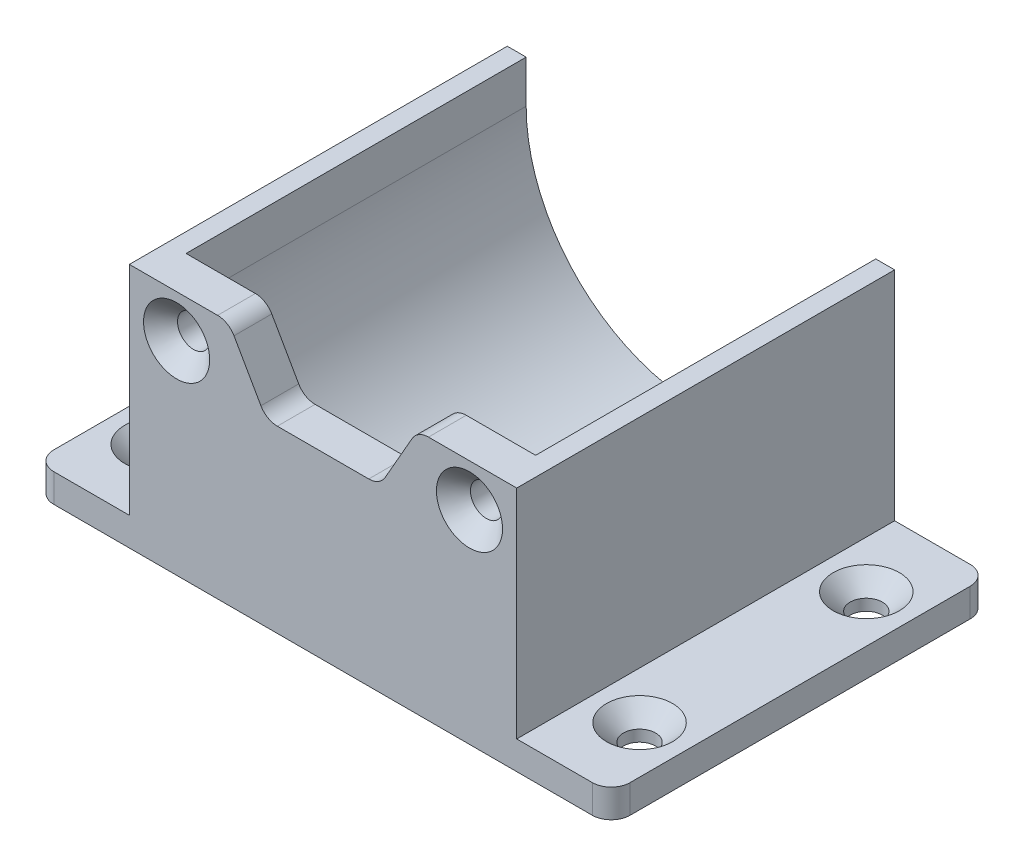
ISO-10303-21;
HEADER;
FILE_DESCRIPTION(('STEP AP214'),'2;1');
FILE_NAME('part.step','',(''),(''),'','','');
FILE_SCHEMA(('AUTOMOTIVE_DESIGN { 1 0 10303 214 1 1 1 1 }'));
ENDSEC;
DATA;
#1=APPLICATION_CONTEXT('core data for automotive mechanical design processes');
#2=APPLICATION_PROTOCOL_DEFINITION('international standard','automotive_design',2000,#1);
#3=PRODUCT_CONTEXT('',#1,'mechanical');
#4=PRODUCT('Part','Part','',(#3));
#5=PRODUCT_RELATED_PRODUCT_CATEGORY('part','',(#4));
#6=PRODUCT_DEFINITION_FORMATION('','',#4);
#7=PRODUCT_DEFINITION_CONTEXT('part definition',#1,'design');
#8=PRODUCT_DEFINITION('design','',#6,#7);
#9=PRODUCT_DEFINITION_SHAPE('','',#8);
#10=(LENGTH_UNIT() NAMED_UNIT(*) SI_UNIT(.MILLI.,.METRE.));
#11=(NAMED_UNIT(*) PLANE_ANGLE_UNIT() SI_UNIT($,.RADIAN.));
#12=(NAMED_UNIT(*) SI_UNIT($,.STERADIAN.) SOLID_ANGLE_UNIT());
#13=UNCERTAINTY_MEASURE_WITH_UNIT(LENGTH_MEASURE(1.E-05),#10,'distance_accuracy_value','');
#14=(GEOMETRIC_REPRESENTATION_CONTEXT(3) GLOBAL_UNCERTAINTY_ASSIGNED_CONTEXT((#13)) GLOBAL_UNIT_ASSIGNED_CONTEXT((#10,
#11,#12)) REPRESENTATION_CONTEXT('',''));
#15=CARTESIAN_POINT('',(0.,0.,0.));
#16=DIRECTION('',(0.,0.,1.));
#17=DIRECTION('',(1.,0.,0.));
#18=AXIS2_PLACEMENT_3D('',#15,#16,#17);
#19=CARTESIAN_POINT('',(0.,8.5,36.));
#20=DIRECTION('',(0.,0.,-1.));
#21=DIRECTION('',(-1.,0.,0.));
#22=AXIS2_PLACEMENT_3D('',#19,#20,#21);
#23=CYLINDRICAL_SURFACE('',#22,18.5);
#24=CARTESIAN_POINT('',(0.,8.5,0.));
#25=DIRECTION('',(0.,0.,1.));
#26=DIRECTION('',(1.,0.,0.));
#27=AXIS2_PLACEMENT_3D('',#24,#25,#26);
#28=CIRCLE('',#27,18.5);
#29=CARTESIAN_POINT('',(-18.5,8.49999999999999,0.));
#30=VERTEX_POINT('',#29);
#31=CARTESIAN_POINT('',(18.5,8.5,0.));
#32=VERTEX_POINT('',#31);
#33=EDGE_CURVE('E252',#30,#32,#28,.T.);
#34=ORIENTED_EDGE('',*,*,#33,.F.);
#35=DIRECTION('',(0.,0.,-1.));
#36=VECTOR('',#35,1.);
#37=CARTESIAN_POINT('',(-18.5,8.49999999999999,36.));
#38=LINE('',#37,#36);
#39=CARTESIAN_POINT('',(-18.5,8.49999999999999,36.));
#40=VERTEX_POINT('',#39);
#41=EDGE_CURVE('E428',#40,#30,#38,.T.);
#42=ORIENTED_EDGE('',*,*,#41,.F.);
#43=CARTESIAN_POINT('',(0.,8.5,36.));
#44=DIRECTION('',(0.,0.,-1.));
#45=DIRECTION('',(-1.,0.,0.));
#46=AXIS2_PLACEMENT_3D('',#43,#44,#45);
#47=CIRCLE('',#46,18.5);
#48=CARTESIAN_POINT('',(18.5,8.5,36.));
#49=VERTEX_POINT('',#48);
#50=EDGE_CURVE('E232',#49,#40,#47,.T.);
#51=ORIENTED_EDGE('',*,*,#50,.F.);
#52=DIRECTION('',(0.,0.,-1.));
#53=VECTOR('',#52,1.);
#54=CARTESIAN_POINT('',(18.5,8.5,36.));
#55=LINE('',#54,#53);
#56=EDGE_CURVE('E440',#49,#32,#55,.T.);
#57=ORIENTED_EDGE('',*,*,#56,.T.);
#58=EDGE_LOOP('',(#34,#42,#51,#57));
#59=FACE_BOUND('',#58,.T.);
#60=ADVANCED_FACE('F33',(#59),#23,.F.);
#61=CARTESIAN_POINT('',(-20.5,13.,40.));
#62=DIRECTION('',(0.,-1.,0.));
#63=DIRECTION('',(0.,0.,-1.));
#64=AXIS2_PLACEMENT_3D('',#61,#62,#63);
#65=PLANE('',#64);
#66=DIRECTION('',(1.,0.,0.));
#67=VECTOR('',#66,1.);
#68=CARTESIAN_POINT('',(-20.5,13.,36.));
#69=LINE('',#68,#67);
#70=CARTESIAN_POINT('',(-18.5,13.,36.));
#71=VERTEX_POINT('',#70);
#72=CARTESIAN_POINT('',(-11.1606450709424,13.,36.));
#73=VERTEX_POINT('',#72);
#74=EDGE_CURVE('E255',#71,#73,#69,.T.);
#75=ORIENTED_EDGE('',*,*,#74,.F.);
#76=DIRECTION('',(0.,0.,-1.));
#77=VECTOR('',#76,1.);
#78=CARTESIAN_POINT('',(-18.5,13.,36.));
#79=LINE('',#78,#77);
#80=CARTESIAN_POINT('',(-18.5,13.,0.));
#81=VERTEX_POINT('',#80);
#82=EDGE_CURVE('E430',#71,#81,#79,.T.);
#83=ORIENTED_EDGE('',*,*,#82,.T.);
#84=DIRECTION('',(-1.,0.,0.));
#85=VECTOR('',#84,1.);
#86=CARTESIAN_POINT('',(-20.5,13.,0.));
#87=LINE('',#86,#85);
#88=CARTESIAN_POINT('',(-20.5,13.,0.));
#89=VERTEX_POINT('',#88);
#90=EDGE_CURVE('E243',#81,#89,#87,.T.);
#91=ORIENTED_EDGE('',*,*,#90,.T.);
#92=DIRECTION('',(0.,0.,-1.));
#93=VECTOR('',#92,1.);
#94=CARTESIAN_POINT('',(-20.5,13.,40.));
#95=LINE('',#94,#93);
#96=CARTESIAN_POINT('',(-20.5,13.,40.));
#97=VERTEX_POINT('',#96);
#98=EDGE_CURVE('E240',#97,#89,#95,.T.);
#99=ORIENTED_EDGE('',*,*,#98,.F.);
#100=DIRECTION('',(-1.,0.,0.));
#101=VECTOR('',#100,1.);
#102=CARTESIAN_POINT('',(-20.5,13.,40.));
#103=LINE('',#102,#101);
#104=CARTESIAN_POINT('',(-11.1606450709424,13.,40.));
#105=VERTEX_POINT('',#104);
#106=EDGE_CURVE('E223',#105,#97,#103,.T.);
#107=ORIENTED_EDGE('',*,*,#106,.F.);
#108=DIRECTION('',(0.,0.,1.));
#109=VECTOR('',#108,1.);
#110=CARTESIAN_POINT('',(-11.1606450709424,13.,40.));
#111=LINE('',#110,#109);
#112=EDGE_CURVE('E312',#105,#73,#111,.F.);
#113=ORIENTED_EDGE('',*,*,#112,.T.);
#114=EDGE_LOOP('',(#75,#83,#91,#99,#107,#113));
#115=FACE_BOUND('',#114,.T.);
#116=ADVANCED_FACE('F487',(#115),#65,.F.);
#117=CARTESIAN_POINT('',(20.5,13.,40.));
#118=DIRECTION('',(-1.,0.,0.));
#119=DIRECTION('',(0.,-1.,0.));
#120=AXIS2_PLACEMENT_3D('',#117,#118,#119);
#121=PLANE('',#120);
#122=DIRECTION('',(0.,1.,0.));
#123=VECTOR('',#122,1.);
#124=CARTESIAN_POINT('',(20.5,13.,40.));
#125=LINE('',#124,#123);
#126=CARTESIAN_POINT('',(20.5,-10.,40.));
#127=VERTEX_POINT('',#126);
#128=CARTESIAN_POINT('',(20.5,13.,40.));
#129=VERTEX_POINT('',#128);
#130=EDGE_CURVE('E202',#127,#129,#125,.T.);
#131=ORIENTED_EDGE('',*,*,#130,.F.);
#132=DIRECTION('',(0.,0.,-1.));
#133=VECTOR('',#132,1.);
#134=CARTESIAN_POINT('',(20.5,-10.,40.));
#135=LINE('',#134,#133);
#136=CARTESIAN_POINT('',(20.5,-9.99999999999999,0.));
#137=VERTEX_POINT('',#136);
#138=EDGE_CURVE('E208',#127,#137,#135,.T.);
#139=ORIENTED_EDGE('',*,*,#138,.T.);
#140=DIRECTION('',(0.,1.,0.));
#141=VECTOR('',#140,1.);
#142=CARTESIAN_POINT('',(20.5,13.,0.));
#143=LINE('',#142,#141);
#144=CARTESIAN_POINT('',(20.5,13.,0.));
#145=VERTEX_POINT('',#144);
#146=EDGE_CURVE('E241',#137,#145,#143,.T.);
#147=ORIENTED_EDGE('',*,*,#146,.T.);
#148=DIRECTION('',(0.,0.,-1.));
#149=VECTOR('',#148,1.);
#150=CARTESIAN_POINT('',(20.5,13.,40.));
#151=LINE('',#150,#149);
#152=EDGE_CURVE('E222',#129,#145,#151,.T.);
#153=ORIENTED_EDGE('',*,*,#152,.F.);
#154=EDGE_LOOP('',(#131,#139,#147,#153));
#155=FACE_BOUND('',#154,.T.);
#156=ADVANCED_FACE('F220',(#155),#121,.F.);
#157=CARTESIAN_POINT('',(18.5,13.,0.));
#158=VERTEX_POINT('',#157);
#159=EDGE_CURVE('E244',#145,#158,#87,.T.);
#160=ORIENTED_EDGE('',*,*,#159,.T.);
#161=DIRECTION('',(0.,0.,-1.));
#162=VECTOR('',#161,1.);
#163=CARTESIAN_POINT('',(18.5,13.,36.));
#164=LINE('',#163,#162);
#165=CARTESIAN_POINT('',(18.5,13.,36.));
#166=VERTEX_POINT('',#165);
#167=EDGE_CURVE('E437',#166,#158,#164,.T.);
#168=ORIENTED_EDGE('',*,*,#167,.F.);
#169=CARTESIAN_POINT('',(11.1606450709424,13.,36.));
#170=VERTEX_POINT('',#169);
#171=EDGE_CURVE('E254',#170,#166,#69,.T.);
#172=ORIENTED_EDGE('',*,*,#171,.F.);
#173=DIRECTION('',(0.,0.,1.));
#174=VECTOR('',#173,1.);
#175=CARTESIAN_POINT('',(11.1606450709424,13.,40.));
#176=LINE('',#175,#174);
#177=CARTESIAN_POINT('',(11.1606450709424,13.,40.));
#178=VERTEX_POINT('',#177);
#179=EDGE_CURVE('E286',#170,#178,#176,.T.);
#180=ORIENTED_EDGE('',*,*,#179,.T.);
#181=EDGE_CURVE('E226',#129,#178,#103,.T.);
#182=ORIENTED_EDGE('',*,*,#181,.F.);
#183=ORIENTED_EDGE('',*,*,#152,.T.);
#184=EDGE_LOOP('',(#160,#168,#172,#180,#182,#183));
#185=FACE_BOUND('',#184,.T.);
#186=ADVANCED_FACE('F467',(#185),#65,.F.);
#187=CARTESIAN_POINT('',(-20.5,13.,40.));
#188=DIRECTION('',(1.,0.,0.));
#189=DIRECTION('',(0.,0.,-1.));
#190=AXIS2_PLACEMENT_3D('',#187,#188,#189);
#191=PLANE('',#190);
#192=DIRECTION('',(0.,-1.,0.));
#193=VECTOR('',#192,1.);
#194=CARTESIAN_POINT('',(-20.5,13.,0.));
#195=LINE('',#194,#193);
#196=CARTESIAN_POINT('',(-20.5,-10.,0.));
#197=VERTEX_POINT('',#196);
#198=EDGE_CURVE('E229',#89,#197,#195,.T.);
#199=ORIENTED_EDGE('',*,*,#198,.T.);
#200=DIRECTION('',(0.,0.,1.));
#201=VECTOR('',#200,1.);
#202=CARTESIAN_POINT('',(-20.5,-10.,40.));
#203=LINE('',#202,#201);
#204=CARTESIAN_POINT('',(-20.5,-9.99999999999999,40.));
#205=VERTEX_POINT('',#204);
#206=EDGE_CURVE('E412',#197,#205,#203,.T.);
#207=ORIENTED_EDGE('',*,*,#206,.T.);
#208=DIRECTION('',(0.,-1.,0.));
#209=VECTOR('',#208,1.);
#210=CARTESIAN_POINT('',(-20.5,13.,40.));
#211=LINE('',#210,#209);
#212=EDGE_CURVE('E235',#97,#205,#211,.T.);
#213=ORIENTED_EDGE('',*,*,#212,.F.);
#214=ORIENTED_EDGE('',*,*,#98,.T.);
#215=EDGE_LOOP('',(#199,#207,#213,#214));
#216=FACE_BOUND('',#215,.T.);
#217=ADVANCED_FACE('F492',(#216),#191,.F.);
#218=CARTESIAN_POINT('',(-20.5,-13.,40.));
#219=DIRECTION('',(0.,1.,0.));
#220=DIRECTION('',(0.,0.,1.));
#221=AXIS2_PLACEMENT_3D('',#218,#219,#220);
#222=PLANE('',#221);
#223=CARTESIAN_POINT('',(-25.5,-13.,32.));
#224=DIRECTION('',(0.,1.,0.));
#225=DIRECTION('',(0.,0.,-1.));
#226=AXIS2_PLACEMENT_3D('',#223,#224,#225);
#227=CIRCLE('',#226,1.7);
#228=CARTESIAN_POINT('',(-25.5,-13.,30.3));
#229=VERTEX_POINT('',#228);
#230=EDGE_CURVE('E392',#229,#229,#227,.T.);
#231=ORIENTED_EDGE('',*,*,#230,.T.);
#232=EDGE_LOOP('',(#231));
#233=FACE_BOUND('',#232,.T.);
#234=CARTESIAN_POINT('',(25.5,-13.,32.));
#235=DIRECTION('',(0.,1.,0.));
#236=DIRECTION('',(0.,0.,1.));
#237=AXIS2_PLACEMENT_3D('',#234,#235,#236);
#238=CIRCLE('',#237,1.7);
#239=CARTESIAN_POINT('',(25.5,-13.,33.7));
#240=VERTEX_POINT('',#239);
#241=EDGE_CURVE('E395',#240,#240,#238,.T.);
#242=ORIENTED_EDGE('',*,*,#241,.T.);
#243=EDGE_LOOP('',(#242));
#244=FACE_BOUND('',#243,.T.);
#245=CARTESIAN_POINT('',(25.5,-13.,8.00000000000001));
#246=DIRECTION('',(0.,1.,0.));
#247=DIRECTION('',(0.,0.,-1.));
#248=AXIS2_PLACEMENT_3D('',#245,#246,#247);
#249=CIRCLE('',#248,1.7);
#250=CARTESIAN_POINT('',(25.5,-13.,6.30000000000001));
#251=VERTEX_POINT('',#250);
#252=EDGE_CURVE('E400',#251,#251,#249,.T.);
#253=ORIENTED_EDGE('',*,*,#252,.T.);
#254=EDGE_LOOP('',(#253));
#255=FACE_BOUND('',#254,.T.);
#256=CARTESIAN_POINT('',(-25.5,-13.,8.));
#257=DIRECTION('',(0.,1.,0.));
#258=DIRECTION('',(0.,0.,1.));
#259=AXIS2_PLACEMENT_3D('',#256,#257,#258);
#260=CIRCLE('',#259,1.7);
#261=CARTESIAN_POINT('',(-25.5,-13.,9.7));
#262=VERTEX_POINT('',#261);
#263=EDGE_CURVE('E394',#262,#262,#260,.T.);
#264=ORIENTED_EDGE('',*,*,#263,.T.);
#265=EDGE_LOOP('',(#264));
#266=FACE_BOUND('',#265,.T.);
#267=DIRECTION('',(1.,0.,0.));
#268=VECTOR('',#267,1.);
#269=CARTESIAN_POINT('',(-20.5,-13.,0.));
#270=LINE('',#269,#268);
#271=CARTESIAN_POINT('',(-28.5,-13.,0.));
#272=VERTEX_POINT('',#271);
#273=CARTESIAN_POINT('',(28.5,-13.,0.));
#274=VERTEX_POINT('',#273);
#275=EDGE_CURVE('E224',#272,#274,#270,.T.);
#276=ORIENTED_EDGE('',*,*,#275,.T.);
#277=CARTESIAN_POINT('',(28.5,-13.,2.));
#278=DIRECTION('',(0.,1.,0.));
#279=DIRECTION('',(0.,0.,1.));
#280=AXIS2_PLACEMENT_3D('',#277,#278,#279);
#281=CIRCLE('',#280,2.);
#282=CARTESIAN_POINT('',(30.5,-13.,2.));
#283=VERTEX_POINT('',#282);
#284=EDGE_CURVE('E333',#274,#283,#281,.F.);
#285=ORIENTED_EDGE('',*,*,#284,.T.);
#286=DIRECTION('',(0.,0.,1.));
#287=VECTOR('',#286,1.);
#288=CARTESIAN_POINT('',(30.5,-13.,40.));
#289=LINE('',#288,#287);
#290=CARTESIAN_POINT('',(30.5,-13.,38.));
#291=VERTEX_POINT('',#290);
#292=EDGE_CURVE('E209',#283,#291,#289,.T.);
#293=ORIENTED_EDGE('',*,*,#292,.T.);
#294=CARTESIAN_POINT('',(28.5,-13.,38.));
#295=DIRECTION('',(0.,1.,0.));
#296=DIRECTION('',(0.,0.,1.));
#297=AXIS2_PLACEMENT_3D('',#294,#295,#296);
#298=CIRCLE('',#297,2.);
#299=CARTESIAN_POINT('',(28.5,-13.,40.));
#300=VERTEX_POINT('',#299);
#301=EDGE_CURVE('E331',#291,#300,#298,.F.);
#302=ORIENTED_EDGE('',*,*,#301,.T.);
#303=DIRECTION('',(1.,0.,0.));
#304=VECTOR('',#303,1.);
#305=CARTESIAN_POINT('',(-20.5,-13.,40.));
#306=LINE('',#305,#304);
#307=CARTESIAN_POINT('',(-28.5,-13.,40.));
#308=VERTEX_POINT('',#307);
#309=EDGE_CURVE('E238',#308,#300,#306,.T.);
#310=ORIENTED_EDGE('',*,*,#309,.F.);
#311=CARTESIAN_POINT('',(-28.5,-13.,38.));
#312=DIRECTION('',(0.,1.,0.));
#313=DIRECTION('',(0.,0.,1.));
#314=AXIS2_PLACEMENT_3D('',#311,#312,#313);
#315=CIRCLE('',#314,2.);
#316=CARTESIAN_POINT('',(-30.5,-13.,38.));
#317=VERTEX_POINT('',#316);
#318=EDGE_CURVE('E327',#308,#317,#315,.F.);
#319=ORIENTED_EDGE('',*,*,#318,.T.);
#320=DIRECTION('',(0.,0.,-1.));
#321=VECTOR('',#320,1.);
#322=CARTESIAN_POINT('',(-30.5,-13.,40.));
#323=LINE('',#322,#321);
#324=CARTESIAN_POINT('',(-30.5,-13.,2.));
#325=VERTEX_POINT('',#324);
#326=EDGE_CURVE('E409',#317,#325,#323,.T.);
#327=ORIENTED_EDGE('',*,*,#326,.T.);
#328=CARTESIAN_POINT('',(-28.5,-13.,2.));
#329=DIRECTION('',(0.,1.,0.));
#330=DIRECTION('',(0.,0.,1.));
#331=AXIS2_PLACEMENT_3D('',#328,#329,#330);
#332=CIRCLE('',#331,2.);
#333=EDGE_CURVE('E329',#325,#272,#332,.F.);
#334=ORIENTED_EDGE('',*,*,#333,.T.);
#335=EDGE_LOOP('',(#276,#285,#293,#302,#310,#319,#327,#334));
#336=FACE_BOUND('',#335,.T.);
#337=ADVANCED_FACE('F535',(#233,#244,#255,#266,#336),#222,.F.);
#338=CARTESIAN_POINT('',(0.,0.,40.));
#339=DIRECTION('',(0.,0.,1.));
#340=DIRECTION('',(1.,0.,0.));
#341=AXIS2_PLACEMENT_3D('',#338,#339,#340);
#342=PLANE('',#341);
#343=ORIENTED_EDGE('',*,*,#309,.T.);
#344=DIRECTION('',(0.,-1.,0.));
#345=VECTOR('',#344,1.);
#346=CARTESIAN_POINT('',(28.5,0.,40.));
#347=LINE('',#346,#345);
#348=CARTESIAN_POINT('',(28.5,-10.,40.));
#349=VERTEX_POINT('',#348);
#350=EDGE_CURVE('E205',#300,#349,#347,.F.);
#351=ORIENTED_EDGE('',*,*,#350,.T.);
#352=DIRECTION('',(-1.,0.,0.));
#353=VECTOR('',#352,1.);
#354=CARTESIAN_POINT('',(20.5,-10.,40.));
#355=LINE('',#354,#353);
#356=EDGE_CURVE('E195',#349,#127,#355,.T.);
#357=ORIENTED_EDGE('',*,*,#356,.T.);
#358=ORIENTED_EDGE('',*,*,#130,.T.);
#359=ORIENTED_EDGE('',*,*,#181,.T.);
#360=CARTESIAN_POINT('',(11.1606450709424,11.,40.));
#361=DIRECTION('',(0.,0.,1.));
#362=DIRECTION('',(1.,0.,0.));
#363=AXIS2_PLACEMENT_3D('',#360,#361,#362);
#364=CIRCLE('',#363,2.);
#365=CARTESIAN_POINT('',(9.42415878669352,11.9922778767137,40.));
#366=VERTEX_POINT('',#365);
#367=EDGE_CURVE('E291',#178,#366,#364,.T.);
#368=ORIENTED_EDGE('',*,*,#367,.T.);
#369=DIRECTION('',(0.496138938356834,0.868243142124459,0.));
#370=VECTOR('',#369,1.);
#371=CARTESIAN_POINT('',(9.99999999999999,13.,40.));
#372=LINE('',#371,#370);
#373=CARTESIAN_POINT('',(6.57584121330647,7.00772212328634,40.));
#374=VERTEX_POINT('',#373);
#375=EDGE_CURVE('E265',#374,#366,#372,.T.);
#376=ORIENTED_EDGE('',*,*,#375,.F.);
#377=CARTESIAN_POINT('',(4.83935492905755,8.,40.));
#378=DIRECTION('',(0.,0.,1.));
#379=DIRECTION('',(1.,0.,0.));
#380=AXIS2_PLACEMENT_3D('',#377,#378,#379);
#381=CIRCLE('',#380,2.);
#382=CARTESIAN_POINT('',(4.83935492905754,6.,40.));
#383=VERTEX_POINT('',#382);
#384=EDGE_CURVE('E314',#374,#383,#381,.F.);
#385=ORIENTED_EDGE('',*,*,#384,.T.);
#386=DIRECTION('',(1.,0.,0.));
#387=VECTOR('',#386,1.);
#388=CARTESIAN_POINT('',(-6.,6.,40.));
#389=LINE('',#388,#387);
#390=CARTESIAN_POINT('',(-4.83935492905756,6.,40.));
#391=VERTEX_POINT('',#390);
#392=EDGE_CURVE('E447',#391,#383,#389,.T.);
#393=ORIENTED_EDGE('',*,*,#392,.F.);
#394=CARTESIAN_POINT('',(-4.83935492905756,8.,40.));
#395=DIRECTION('',(0.,0.,1.));
#396=DIRECTION('',(1.,0.,0.));
#397=AXIS2_PLACEMENT_3D('',#394,#395,#396);
#398=CIRCLE('',#397,2.);
#399=CARTESIAN_POINT('',(-6.57584121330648,7.00772212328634,40.));
#400=VERTEX_POINT('',#399);
#401=EDGE_CURVE('E318',#391,#400,#398,.F.);
#402=ORIENTED_EDGE('',*,*,#401,.T.);
#403=DIRECTION('',(0.496138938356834,-0.868243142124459,0.));
#404=VECTOR('',#403,1.);
#405=CARTESIAN_POINT('',(-10.,13.,40.));
#406=LINE('',#405,#404);
#407=CARTESIAN_POINT('',(-9.42415878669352,11.9922778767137,40.));
#408=VERTEX_POINT('',#407);
#409=EDGE_CURVE('E443',#408,#400,#406,.T.);
#410=ORIENTED_EDGE('',*,*,#409,.F.);
#411=CARTESIAN_POINT('',(-11.1606450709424,11.,40.));
#412=DIRECTION('',(0.,0.,1.));
#413=DIRECTION('',(1.,0.,0.));
#414=AXIS2_PLACEMENT_3D('',#411,#412,#413);
#415=CIRCLE('',#414,2.);
#416=EDGE_CURVE('E289',#408,#105,#415,.T.);
#417=ORIENTED_EDGE('',*,*,#416,.T.);
#418=ORIENTED_EDGE('',*,*,#106,.T.);
#419=ORIENTED_EDGE('',*,*,#212,.T.);
#420=DIRECTION('',(-1.,0.,0.));
#421=VECTOR('',#420,1.);
#422=CARTESIAN_POINT('',(-20.5,-10.,40.));
#423=LINE('',#422,#421);
#424=CARTESIAN_POINT('',(-28.5,-10.,40.));
#425=VERTEX_POINT('',#424);
#426=EDGE_CURVE('E415',#205,#425,#423,.T.);
#427=ORIENTED_EDGE('',*,*,#426,.T.);
#428=DIRECTION('',(0.,-1.,0.));
#429=VECTOR('',#428,1.);
#430=CARTESIAN_POINT('',(-28.5,0.,40.));
#431=LINE('',#430,#429);
#432=EDGE_CURVE('E344',#425,#308,#431,.T.);
#433=ORIENTED_EDGE('',*,*,#432,.T.);
#434=EDGE_LOOP('',(#343,#351,#357,#358,#359,#368,#376,#385,#393,#402,#410,#417,#418,#419,#427,#433));
#435=FACE_BOUND('',#434,.T.);
#436=CARTESIAN_POINT('',(15.5,8.5,40.));
#437=DIRECTION('',(0.,0.,1.));
#438=DIRECTION('',(1.,0.,0.));
#439=AXIS2_PLACEMENT_3D('',#436,#437,#438);
#440=CIRCLE('',#439,3.50000000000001);
#441=CARTESIAN_POINT('',(19.,8.5,40.));
#442=VERTEX_POINT('',#441);
#443=EDGE_CURVE('E271',#442,#442,#440,.F.);
#444=ORIENTED_EDGE('',*,*,#443,.T.);
#445=EDGE_LOOP('',(#444));
#446=FACE_BOUND('',#445,.T.);
#447=CARTESIAN_POINT('',(-15.5,8.5,40.));
#448=DIRECTION('',(0.,0.,1.));
#449=DIRECTION('',(1.,0.,0.));
#450=AXIS2_PLACEMENT_3D('',#447,#448,#449);
#451=CIRCLE('',#450,3.50000000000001);
#452=CARTESIAN_POINT('',(-12.,8.5,40.));
#453=VERTEX_POINT('',#452);
#454=EDGE_CURVE('E268',#453,#453,#451,.F.);
#455=ORIENTED_EDGE('',*,*,#454,.T.);
#456=EDGE_LOOP('',(#455));
#457=FACE_BOUND('',#456,.T.);
#458=ADVANCED_FACE('F198',(#435,#446,#457),#342,.T.);
#459=CARTESIAN_POINT('',(0.,0.,0.));
#460=DIRECTION('',(0.,0.,1.));
#461=DIRECTION('',(1.,0.,0.));
#462=AXIS2_PLACEMENT_3D('',#459,#460,#461);
#463=PLANE('',#462);
#464=DIRECTION('',(1.,0.,0.));
#465=VECTOR('',#464,1.);
#466=CARTESIAN_POINT('',(20.5,-10.,0.));
#467=LINE('',#466,#465);
#468=CARTESIAN_POINT('',(28.5,-10.,0.));
#469=VERTEX_POINT('',#468);
#470=EDGE_CURVE('E215',#137,#469,#467,.T.);
#471=ORIENTED_EDGE('',*,*,#470,.T.);
#472=DIRECTION('',(0.,-1.,0.));
#473=VECTOR('',#472,1.);
#474=CARTESIAN_POINT('',(28.5,-13.,0.));
#475=LINE('',#474,#473);
#476=EDGE_CURVE('E324',#469,#274,#475,.T.);
#477=ORIENTED_EDGE('',*,*,#476,.T.);
#478=ORIENTED_EDGE('',*,*,#275,.F.);
#479=DIRECTION('',(0.,-1.,0.));
#480=VECTOR('',#479,1.);
#481=CARTESIAN_POINT('',(-28.5,-10.,0.));
#482=LINE('',#481,#480);
#483=CARTESIAN_POINT('',(-28.5,-10.,0.));
#484=VERTEX_POINT('',#483);
#485=EDGE_CURVE('E322',#272,#484,#482,.F.);
#486=ORIENTED_EDGE('',*,*,#485,.T.);
#487=DIRECTION('',(1.,0.,0.));
#488=VECTOR('',#487,1.);
#489=CARTESIAN_POINT('',(-20.5,-10.,0.));
#490=LINE('',#489,#488);
#491=EDGE_CURVE('E420',#484,#197,#490,.T.);
#492=ORIENTED_EDGE('',*,*,#491,.T.);
#493=ORIENTED_EDGE('',*,*,#198,.F.);
#494=ORIENTED_EDGE('',*,*,#90,.F.);
#495=DIRECTION('',(0.,1.,0.));
#496=VECTOR('',#495,1.);
#497=CARTESIAN_POINT('',(-18.5,8.49999999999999,0.));
#498=LINE('',#497,#496);
#499=EDGE_CURVE('E422',#30,#81,#498,.T.);
#500=ORIENTED_EDGE('',*,*,#499,.F.);
#501=ORIENTED_EDGE('',*,*,#33,.T.);
#502=DIRECTION('',(0.,-1.,0.));
#503=VECTOR('',#502,1.);
#504=CARTESIAN_POINT('',(18.5,8.5,0.));
#505=LINE('',#504,#503);
#506=EDGE_CURVE('E433',#158,#32,#505,.T.);
#507=ORIENTED_EDGE('',*,*,#506,.F.);
#508=ORIENTED_EDGE('',*,*,#159,.F.);
#509=ORIENTED_EDGE('',*,*,#146,.F.);
#510=EDGE_LOOP('',(#471,#477,#478,#486,#492,#493,#494,#500,#501,#507,#508,#509));
#511=FACE_BOUND('',#510,.T.);
#512=ADVANCED_FACE('F474',(#511),#463,.F.);
#513=CARTESIAN_POINT('',(0.,8.5,36.));
#514=DIRECTION('',(0.,0.,-1.));
#515=DIRECTION('',(-1.,0.,0.));
#516=AXIS2_PLACEMENT_3D('',#513,#514,#515);
#517=PLANE('',#516);
#518=DIRECTION('',(-0.496138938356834,-0.868243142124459,0.));
#519=VECTOR('',#518,1.);
#520=CARTESIAN_POINT('',(5.59999999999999,5.3,36.));
#521=LINE('',#520,#519);
#522=CARTESIAN_POINT('',(9.42415878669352,11.9922778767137,36.));
#523=VERTEX_POINT('',#522);
#524=CARTESIAN_POINT('',(6.57584121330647,7.00772212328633,36.));
#525=VERTEX_POINT('',#524);
#526=EDGE_CURVE('E280',#523,#525,#521,.T.);
#527=ORIENTED_EDGE('',*,*,#526,.F.);
#528=CARTESIAN_POINT('',(11.1606450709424,11.,36.));
#529=DIRECTION('',(0.,0.,-1.));
#530=DIRECTION('',(-1.,0.,0.));
#531=AXIS2_PLACEMENT_3D('',#528,#529,#530);
#532=CIRCLE('',#531,2.);
#533=EDGE_CURVE('E300',#523,#170,#532,.T.);
#534=ORIENTED_EDGE('',*,*,#533,.T.);
#535=ORIENTED_EDGE('',*,*,#171,.T.);
#536=DIRECTION('',(0.,-1.,0.));
#537=VECTOR('',#536,1.);
#538=CARTESIAN_POINT('',(18.5,8.5,36.));
#539=LINE('',#538,#537);
#540=EDGE_CURVE('E435',#166,#49,#539,.T.);
#541=ORIENTED_EDGE('',*,*,#540,.T.);
#542=ORIENTED_EDGE('',*,*,#50,.T.);
#543=DIRECTION('',(0.,1.,0.));
#544=VECTOR('',#543,1.);
#545=CARTESIAN_POINT('',(-18.5,8.49999999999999,36.));
#546=LINE('',#545,#544);
#547=EDGE_CURVE('E425',#40,#71,#546,.T.);
#548=ORIENTED_EDGE('',*,*,#547,.T.);
#549=ORIENTED_EDGE('',*,*,#74,.T.);
#550=CARTESIAN_POINT('',(-11.1606450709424,11.,36.));
#551=DIRECTION('',(0.,0.,-1.));
#552=DIRECTION('',(-1.,0.,0.));
#553=AXIS2_PLACEMENT_3D('',#550,#551,#552);
#554=CIRCLE('',#553,2.);
#555=CARTESIAN_POINT('',(-9.42415878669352,11.9922778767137,36.));
#556=VERTEX_POINT('',#555);
#557=EDGE_CURVE('E298',#73,#556,#554,.T.);
#558=ORIENTED_EDGE('',*,*,#557,.T.);
#559=DIRECTION('',(-0.496138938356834,0.868243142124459,0.));
#560=VECTOR('',#559,1.);
#561=CARTESIAN_POINT('',(-5.6,5.3,36.));
#562=LINE('',#561,#560);
#563=CARTESIAN_POINT('',(-6.57584121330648,7.00772212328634,36.));
#564=VERTEX_POINT('',#563);
#565=EDGE_CURVE('E283',#564,#556,#562,.T.);
#566=ORIENTED_EDGE('',*,*,#565,.F.);
#567=CARTESIAN_POINT('',(-4.83935492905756,8.,36.));
#568=DIRECTION('',(0.,0.,-1.));
#569=DIRECTION('',(-1.,0.,0.));
#570=AXIS2_PLACEMENT_3D('',#567,#568,#569);
#571=CIRCLE('',#570,2.);
#572=CARTESIAN_POINT('',(-4.83935492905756,6.,36.));
#573=VERTEX_POINT('',#572);
#574=EDGE_CURVE('E320',#564,#573,#571,.F.);
#575=ORIENTED_EDGE('',*,*,#574,.T.);
#576=DIRECTION('',(-1.,0.,0.));
#577=VECTOR('',#576,1.);
#578=CARTESIAN_POINT('',(0.,6.,36.));
#579=LINE('',#578,#577);
#580=CARTESIAN_POINT('',(4.83935492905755,6.,36.));
#581=VERTEX_POINT('',#580);
#582=EDGE_CURVE('E277',#581,#573,#579,.T.);
#583=ORIENTED_EDGE('',*,*,#582,.F.);
#584=CARTESIAN_POINT('',(4.83935492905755,8.,36.));
#585=DIRECTION('',(0.,0.,-1.));
#586=DIRECTION('',(-1.,0.,0.));
#587=AXIS2_PLACEMENT_3D('',#584,#585,#586);
#588=CIRCLE('',#587,2.);
#589=EDGE_CURVE('E316',#581,#525,#588,.F.);
#590=ORIENTED_EDGE('',*,*,#589,.T.);
#591=EDGE_LOOP('',(#527,#534,#535,#541,#542,#548,#549,#558,#566,#575,#583,#590));
#592=FACE_BOUND('',#591,.T.);
#593=CARTESIAN_POINT('',(15.5,8.5,36.));
#594=DIRECTION('',(0.,0.,-1.));
#595=DIRECTION('',(-1.,0.,0.));
#596=AXIS2_PLACEMENT_3D('',#593,#594,#595);
#597=CIRCLE('',#596,1.7);
#598=CARTESIAN_POINT('',(13.8,8.5,36.));
#599=VERTEX_POINT('',#598);
#600=EDGE_CURVE('E262',#599,#599,#597,.T.);
#601=ORIENTED_EDGE('',*,*,#600,.F.);
#602=EDGE_LOOP('',(#601));
#603=FACE_BOUND('',#602,.T.);
#604=CARTESIAN_POINT('',(-15.5,8.5,36.));
#605=DIRECTION('',(0.,0.,-1.));
#606=DIRECTION('',(-1.,0.,0.));
#607=AXIS2_PLACEMENT_3D('',#604,#605,#606);
#608=CIRCLE('',#607,1.7);
#609=CARTESIAN_POINT('',(-17.2,8.5,36.));
#610=VERTEX_POINT('',#609);
#611=EDGE_CURVE('E259',#610,#610,#608,.T.);
#612=ORIENTED_EDGE('',*,*,#611,.F.);
#613=EDGE_LOOP('',(#612));
#614=FACE_BOUND('',#613,.T.);
#615=ADVANCED_FACE('F462',(#592,#603,#614),#517,.T.);
#616=CARTESIAN_POINT('',(-15.5,8.5,4.));
#617=DIRECTION('',(0.,0.,1.));
#618=DIRECTION('',(1.,0.,0.));
#619=AXIS2_PLACEMENT_3D('',#616,#617,#618);
#620=CYLINDRICAL_SURFACE('',#619,1.7);
#621=CARTESIAN_POINT('',(-15.5,8.5,38.2));
#622=DIRECTION('',(0.,0.,1.));
#623=DIRECTION('',(1.,0.,0.));
#624=AXIS2_PLACEMENT_3D('',#621,#622,#623);
#625=CIRCLE('',#624,1.7);
#626=CARTESIAN_POINT('',(-13.8,8.5,38.2));
#627=VERTEX_POINT('',#626);
#628=EDGE_CURVE('E274',#627,#627,#625,.T.);
#629=ORIENTED_EDGE('',*,*,#628,.T.);
#630=EDGE_LOOP('',(#629));
#631=FACE_BOUND('',#630,.T.);
#632=ORIENTED_EDGE('',*,*,#611,.T.);
#633=EDGE_LOOP('',(#632));
#634=FACE_BOUND('',#633,.T.);
#635=ADVANCED_FACE('F561',(#631,#634),#620,.F.);
#636=CARTESIAN_POINT('',(15.5,8.5,4.));
#637=DIRECTION('',(0.,0.,1.));
#638=DIRECTION('',(1.,0.,0.));
#639=AXIS2_PLACEMENT_3D('',#636,#637,#638);
#640=CYLINDRICAL_SURFACE('',#639,1.7);
#641=CARTESIAN_POINT('',(15.5,8.5,38.2));
#642=DIRECTION('',(0.,0.,1.));
#643=DIRECTION('',(1.,0.,0.));
#644=AXIS2_PLACEMENT_3D('',#641,#642,#643);
#645=CIRCLE('',#644,1.7);
#646=CARTESIAN_POINT('',(17.2,8.5,38.2));
#647=VERTEX_POINT('',#646);
#648=EDGE_CURVE('E258',#647,#647,#645,.T.);
#649=ORIENTED_EDGE('',*,*,#648,.T.);
#650=EDGE_LOOP('',(#649));
#651=FACE_BOUND('',#650,.T.);
#652=ORIENTED_EDGE('',*,*,#600,.T.);
#653=EDGE_LOOP('',(#652));
#654=FACE_BOUND('',#653,.T.);
#655=ADVANCED_FACE('F549',(#651,#654),#640,.F.);
#656=CARTESIAN_POINT('',(15.5,8.5,38.2));
#657=DIRECTION('',(0.,0.,1.));
#658=DIRECTION('',(1.,0.,0.));
#659=AXIS2_PLACEMENT_3D('',#656,#657,#658);
#660=CONICAL_SURFACE('',#659,1.7,0.785398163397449);
#661=ORIENTED_EDGE('',*,*,#443,.F.);
#662=EDGE_LOOP('',(#661));
#663=FACE_BOUND('',#662,.T.);
#664=ORIENTED_EDGE('',*,*,#648,.F.);
#665=EDGE_LOOP('',(#664));
#666=FACE_BOUND('',#665,.T.);
#667=ADVANCED_FACE('F545',(#663,#666),#660,.F.);
#668=CARTESIAN_POINT('',(-15.5,8.5,38.2));
#669=DIRECTION('',(0.,0.,1.));
#670=DIRECTION('',(1.,0.,0.));
#671=AXIS2_PLACEMENT_3D('',#668,#669,#670);
#672=CONICAL_SURFACE('',#671,1.7,0.785398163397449);
#673=ORIENTED_EDGE('',*,*,#454,.F.);
#674=EDGE_LOOP('',(#673));
#675=FACE_BOUND('',#674,.T.);
#676=ORIENTED_EDGE('',*,*,#628,.F.);
#677=EDGE_LOOP('',(#676));
#678=FACE_BOUND('',#677,.T.);
#679=ADVANCED_FACE('F548',(#675,#678),#672,.F.);
#680=CARTESIAN_POINT('',(-10.,13.,0.));
#681=DIRECTION('',(-0.868243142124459,-0.496138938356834,0.));
#682=DIRECTION('',(0.496138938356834,-0.868243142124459,0.));
#683=AXIS2_PLACEMENT_3D('',#680,#681,#682);
#684=PLANE('',#683);
#685=ORIENTED_EDGE('',*,*,#409,.T.);
#686=DIRECTION('',(0.,0.,1.));
#687=VECTOR('',#686,1.);
#688=CARTESIAN_POINT('',(-6.57584121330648,7.00772212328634,36.));
#689=LINE('',#688,#687);
#690=EDGE_CURVE('E310',#400,#564,#689,.F.);
#691=ORIENTED_EDGE('',*,*,#690,.T.);
#692=ORIENTED_EDGE('',*,*,#565,.T.);
#693=DIRECTION('',(0.,0.,1.));
#694=VECTOR('',#693,1.);
#695=CARTESIAN_POINT('',(-9.42415878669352,11.9922778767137,0.));
#696=LINE('',#695,#694);
#697=EDGE_CURVE('E307',#556,#408,#696,.T.);
#698=ORIENTED_EDGE('',*,*,#697,.T.);
#699=EDGE_LOOP('',(#685,#691,#692,#698));
#700=FACE_BOUND('',#699,.T.);
#701=ADVANCED_FACE('F502',(#700),#684,.F.);
#702=CARTESIAN_POINT('',(9.99999999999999,13.,0.));
#703=DIRECTION('',(0.868243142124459,-0.496138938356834,0.));
#704=DIRECTION('',(0.496138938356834,0.868243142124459,0.));
#705=AXIS2_PLACEMENT_3D('',#702,#703,#704);
#706=PLANE('',#705);
#707=ORIENTED_EDGE('',*,*,#375,.T.);
#708=DIRECTION('',(0.,0.,1.));
#709=VECTOR('',#708,1.);
#710=CARTESIAN_POINT('',(9.42415878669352,11.9922778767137,0.));
#711=LINE('',#710,#709);
#712=EDGE_CURVE('E296',#366,#523,#711,.F.);
#713=ORIENTED_EDGE('',*,*,#712,.T.);
#714=ORIENTED_EDGE('',*,*,#526,.T.);
#715=DIRECTION('',(0.,0.,1.));
#716=VECTOR('',#715,1.);
#717=CARTESIAN_POINT('',(6.57584121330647,7.00772212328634,40.));
#718=LINE('',#717,#716);
#719=EDGE_CURVE('E293',#525,#374,#718,.T.);
#720=ORIENTED_EDGE('',*,*,#719,.T.);
#721=EDGE_LOOP('',(#707,#713,#714,#720));
#722=FACE_BOUND('',#721,.T.);
#723=ADVANCED_FACE('F453',(#722),#706,.F.);
#724=CARTESIAN_POINT('',(-6.,6.,0.));
#725=DIRECTION('',(0.,-1.,0.));
#726=DIRECTION('',(1.,0.,0.));
#727=AXIS2_PLACEMENT_3D('',#724,#725,#726);
#728=PLANE('',#727);
#729=ORIENTED_EDGE('',*,*,#392,.T.);
#730=DIRECTION('',(0.,0.,1.));
#731=VECTOR('',#730,1.);
#732=CARTESIAN_POINT('',(4.83935492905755,6.,36.));
#733=LINE('',#732,#731);
#734=EDGE_CURVE('E305',#383,#581,#733,.F.);
#735=ORIENTED_EDGE('',*,*,#734,.T.);
#736=ORIENTED_EDGE('',*,*,#582,.T.);
#737=DIRECTION('',(0.,0.,1.));
#738=VECTOR('',#737,1.);
#739=CARTESIAN_POINT('',(-4.83935492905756,6.,40.));
#740=LINE('',#739,#738);
#741=EDGE_CURVE('E302',#573,#391,#740,.T.);
#742=ORIENTED_EDGE('',*,*,#741,.T.);
#743=EDGE_LOOP('',(#729,#735,#736,#742));
#744=FACE_BOUND('',#743,.T.);
#745=ADVANCED_FACE('F511',(#744),#728,.F.);
#746=CARTESIAN_POINT('',(11.1606450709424,11.,40.));
#747=DIRECTION('',(0.,0.,1.));
#748=DIRECTION('',(1.,0.,0.));
#749=AXIS2_PLACEMENT_3D('',#746,#747,#748);
#750=CYLINDRICAL_SURFACE('',#749,2.);
#751=ORIENTED_EDGE('',*,*,#533,.F.);
#752=ORIENTED_EDGE('',*,*,#712,.F.);
#753=ORIENTED_EDGE('',*,*,#367,.F.);
#754=ORIENTED_EDGE('',*,*,#179,.F.);
#755=EDGE_LOOP('',(#751,#752,#753,#754));
#756=FACE_BOUND('',#755,.T.);
#757=ADVANCED_FACE('F458',(#756),#750,.T.);
#758=CARTESIAN_POINT('',(4.83935492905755,8.,0.));
#759=DIRECTION('',(0.,0.,-1.));
#760=DIRECTION('',(-1.,0.,0.));
#761=AXIS2_PLACEMENT_3D('',#758,#759,#760);
#762=CYLINDRICAL_SURFACE('',#761,2.);
#763=ORIENTED_EDGE('',*,*,#589,.F.);
#764=ORIENTED_EDGE('',*,*,#734,.F.);
#765=ORIENTED_EDGE('',*,*,#384,.F.);
#766=ORIENTED_EDGE('',*,*,#719,.F.);
#767=EDGE_LOOP('',(#763,#764,#765,#766));
#768=FACE_BOUND('',#767,.T.);
#769=ADVANCED_FACE('F515',(#768),#762,.F.);
#770=CARTESIAN_POINT('',(-4.83935492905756,8.,0.));
#771=DIRECTION('',(0.,0.,-1.));
#772=DIRECTION('',(-1.,0.,0.));
#773=AXIS2_PLACEMENT_3D('',#770,#771,#772);
#774=CYLINDRICAL_SURFACE('',#773,2.);
#775=ORIENTED_EDGE('',*,*,#574,.F.);
#776=ORIENTED_EDGE('',*,*,#690,.F.);
#777=ORIENTED_EDGE('',*,*,#401,.F.);
#778=ORIENTED_EDGE('',*,*,#741,.F.);
#779=EDGE_LOOP('',(#775,#776,#777,#778));
#780=FACE_BOUND('',#779,.T.);
#781=ADVANCED_FACE('F506',(#780),#774,.F.);
#782=CARTESIAN_POINT('',(-11.1606450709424,11.,0.));
#783=DIRECTION('',(0.,0.,1.));
#784=DIRECTION('',(1.,0.,0.));
#785=AXIS2_PLACEMENT_3D('',#782,#783,#784);
#786=CYLINDRICAL_SURFACE('',#785,2.);
#787=ORIENTED_EDGE('',*,*,#557,.F.);
#788=ORIENTED_EDGE('',*,*,#112,.F.);
#789=ORIENTED_EDGE('',*,*,#416,.F.);
#790=ORIENTED_EDGE('',*,*,#697,.F.);
#791=EDGE_LOOP('',(#787,#788,#789,#790));
#792=FACE_BOUND('',#791,.T.);
#793=ADVANCED_FACE('F497',(#792),#786,.T.);
#794=CARTESIAN_POINT('',(18.5,8.5,36.));
#795=DIRECTION('',(1.,0.,0.));
#796=DIRECTION('',(0.,1.,0.));
#797=AXIS2_PLACEMENT_3D('',#794,#795,#796);
#798=PLANE('',#797);
#799=ORIENTED_EDGE('',*,*,#506,.T.);
#800=ORIENTED_EDGE('',*,*,#56,.F.);
#801=ORIENTED_EDGE('',*,*,#540,.F.);
#802=ORIENTED_EDGE('',*,*,#167,.T.);
#803=EDGE_LOOP('',(#799,#800,#801,#802));
#804=FACE_BOUND('',#803,.T.);
#805=ADVANCED_FACE('F471',(#804),#798,.F.);
#806=CARTESIAN_POINT('',(-18.5,8.49999999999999,36.));
#807=DIRECTION('',(-1.,0.,0.));
#808=DIRECTION('',(0.,-1.,0.));
#809=AXIS2_PLACEMENT_3D('',#806,#807,#808);
#810=PLANE('',#809);
#811=ORIENTED_EDGE('',*,*,#499,.T.);
#812=ORIENTED_EDGE('',*,*,#82,.F.);
#813=ORIENTED_EDGE('',*,*,#547,.F.);
#814=ORIENTED_EDGE('',*,*,#41,.T.);
#815=EDGE_LOOP('',(#811,#812,#813,#814));
#816=FACE_BOUND('',#815,.T.);
#817=ADVANCED_FACE('F485',(#816),#810,.F.);
#818=CARTESIAN_POINT('',(-30.5,-10.,40.));
#819=DIRECTION('',(-1.,0.,0.));
#820=DIRECTION('',(0.,0.,1.));
#821=AXIS2_PLACEMENT_3D('',#818,#819,#820);
#822=PLANE('',#821);
#823=DIRECTION('',(0.,0.,-1.));
#824=VECTOR('',#823,1.);
#825=CARTESIAN_POINT('',(-30.5,-10.,40.));
#826=LINE('',#825,#824);
#827=CARTESIAN_POINT('',(-30.5,-10.,38.));
#828=VERTEX_POINT('',#827);
#829=CARTESIAN_POINT('',(-30.5,-10.,2.));
#830=VERTEX_POINT('',#829);
#831=EDGE_CURVE('E418',#828,#830,#826,.T.);
#832=ORIENTED_EDGE('',*,*,#831,.T.);
#833=DIRECTION('',(0.,-1.,0.));
#834=VECTOR('',#833,1.);
#835=CARTESIAN_POINT('',(-30.5,-13.,2.));
#836=LINE('',#835,#834);
#837=EDGE_CURVE('E349',#830,#325,#836,.T.);
#838=ORIENTED_EDGE('',*,*,#837,.T.);
#839=ORIENTED_EDGE('',*,*,#326,.F.);
#840=DIRECTION('',(0.,-1.,0.));
#841=VECTOR('',#840,1.);
#842=CARTESIAN_POINT('',(-30.5,-10.,38.));
#843=LINE('',#842,#841);
#844=EDGE_CURVE('E55',#317,#828,#843,.F.);
#845=ORIENTED_EDGE('',*,*,#844,.T.);
#846=EDGE_LOOP('',(#832,#838,#839,#845));
#847=FACE_BOUND('',#846,.T.);
#848=ADVANCED_FACE('F685',(#847),#822,.T.);
#849=CARTESIAN_POINT('',(0.,-10.,0.));
#850=DIRECTION('',(0.,1.,0.));
#851=DIRECTION('',(0.,0.,1.));
#852=AXIS2_PLACEMENT_3D('',#849,#850,#851);
#853=PLANE('',#852);
#854=CARTESIAN_POINT('',(-25.5,-10.,32.));
#855=DIRECTION('',(0.,1.,0.));
#856=DIRECTION('',(0.,0.,1.));
#857=AXIS2_PLACEMENT_3D('',#854,#855,#856);
#858=CIRCLE('',#857,3.50000000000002);
#859=CARTESIAN_POINT('',(-25.5,-10.,35.5));
#860=VERTEX_POINT('',#859);
#861=EDGE_CURVE('E41',#860,#860,#858,.F.);
#862=ORIENTED_EDGE('',*,*,#861,.T.);
#863=EDGE_LOOP('',(#862));
#864=FACE_BOUND('',#863,.T.);
#865=CARTESIAN_POINT('',(-25.5,-10.,8.));
#866=DIRECTION('',(0.,1.,0.));
#867=DIRECTION('',(0.,0.,1.));
#868=AXIS2_PLACEMENT_3D('',#865,#866,#867);
#869=CIRCLE('',#868,3.50000000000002);
#870=CARTESIAN_POINT('',(-25.5,-10.,11.5));
#871=VERTEX_POINT('',#870);
#872=EDGE_CURVE('E370',#871,#871,#869,.F.);
#873=ORIENTED_EDGE('',*,*,#872,.T.);
#874=EDGE_LOOP('',(#873));
#875=FACE_BOUND('',#874,.T.);
#876=ORIENTED_EDGE('',*,*,#491,.F.);
#877=CARTESIAN_POINT('',(-28.5,-10.,2.));
#878=DIRECTION('',(0.,1.,0.));
#879=DIRECTION('',(0.,0.,1.));
#880=AXIS2_PLACEMENT_3D('',#877,#878,#879);
#881=CIRCLE('',#880,2.);
#882=EDGE_CURVE('E48',#484,#830,#881,.T.);
#883=ORIENTED_EDGE('',*,*,#882,.T.);
#884=ORIENTED_EDGE('',*,*,#831,.F.);
#885=CARTESIAN_POINT('',(-28.5,-10.,38.));
#886=DIRECTION('',(0.,1.,0.));
#887=DIRECTION('',(0.,0.,1.));
#888=AXIS2_PLACEMENT_3D('',#885,#886,#887);
#889=CIRCLE('',#888,2.);
#890=EDGE_CURVE('E352',#828,#425,#889,.T.);
#891=ORIENTED_EDGE('',*,*,#890,.T.);
#892=ORIENTED_EDGE('',*,*,#426,.F.);
#893=ORIENTED_EDGE('',*,*,#206,.F.);
#894=EDGE_LOOP('',(#876,#883,#884,#891,#892,#893));
#895=FACE_BOUND('',#894,.T.);
#896=ADVANCED_FACE('F375',(#864,#875,#895),#853,.T.);
#897=CARTESIAN_POINT('',(30.5,-10.,40.));
#898=DIRECTION('',(1.,0.,0.));
#899=DIRECTION('',(0.,0.,-1.));
#900=AXIS2_PLACEMENT_3D('',#897,#898,#899);
#901=PLANE('',#900);
#902=ORIENTED_EDGE('',*,*,#292,.F.);
#903=DIRECTION('',(0.,-1.,0.));
#904=VECTOR('',#903,1.);
#905=CARTESIAN_POINT('',(30.5,-10.,2.));
#906=LINE('',#905,#904);
#907=CARTESIAN_POINT('',(30.5,-10.,2.));
#908=VERTEX_POINT('',#907);
#909=EDGE_CURVE('E338',#283,#908,#906,.F.);
#910=ORIENTED_EDGE('',*,*,#909,.T.);
#911=DIRECTION('',(0.,0.,1.));
#912=VECTOR('',#911,1.);
#913=CARTESIAN_POINT('',(30.5,-10.,40.));
#914=LINE('',#913,#912);
#915=CARTESIAN_POINT('',(30.5,-10.,38.));
#916=VERTEX_POINT('',#915);
#917=EDGE_CURVE('E406',#908,#916,#914,.T.);
#918=ORIENTED_EDGE('',*,*,#917,.T.);
#919=DIRECTION('',(0.,-1.,0.));
#920=VECTOR('',#919,1.);
#921=CARTESIAN_POINT('',(30.5,-10.,38.));
#922=LINE('',#921,#920);
#923=EDGE_CURVE('E335',#916,#291,#922,.T.);
#924=ORIENTED_EDGE('',*,*,#923,.T.);
#925=EDGE_LOOP('',(#902,#910,#918,#924));
#926=FACE_BOUND('',#925,.T.);
#927=ADVANCED_FACE('F696',(#926),#901,.T.);
#928=CARTESIAN_POINT('',(0.,-10.,0.));
#929=DIRECTION('',(0.,1.,0.));
#930=DIRECTION('',(0.,0.,1.));
#931=AXIS2_PLACEMENT_3D('',#928,#929,#930);
#932=PLANE('',#931);
#933=CARTESIAN_POINT('',(25.5,-10.,8.00000000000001));
#934=DIRECTION('',(0.,1.,0.));
#935=DIRECTION('',(0.,0.,1.));
#936=AXIS2_PLACEMENT_3D('',#933,#934,#935);
#937=CIRCLE('',#936,3.50000000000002);
#938=CARTESIAN_POINT('',(25.5,-10.,11.5));
#939=VERTEX_POINT('',#938);
#940=EDGE_CURVE('E361',#939,#939,#937,.F.);
#941=ORIENTED_EDGE('',*,*,#940,.T.);
#942=EDGE_LOOP('',(#941));
#943=FACE_BOUND('',#942,.T.);
#944=CARTESIAN_POINT('',(25.5,-10.,32.));
#945=DIRECTION('',(0.,1.,0.));
#946=DIRECTION('',(0.,0.,1.));
#947=AXIS2_PLACEMENT_3D('',#944,#945,#946);
#948=CIRCLE('',#947,3.50000000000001);
#949=CARTESIAN_POINT('',(25.5,-10.,35.5));
#950=VERTEX_POINT('',#949);
#951=EDGE_CURVE('E358',#950,#950,#948,.F.);
#952=ORIENTED_EDGE('',*,*,#951,.T.);
#953=EDGE_LOOP('',(#952));
#954=FACE_BOUND('',#953,.T.);
#955=ORIENTED_EDGE('',*,*,#917,.F.);
#956=CARTESIAN_POINT('',(28.5,-10.,2.));
#957=DIRECTION('',(0.,1.,0.));
#958=DIRECTION('',(0.,0.,1.));
#959=AXIS2_PLACEMENT_3D('',#956,#957,#958);
#960=CIRCLE('',#959,2.);
#961=EDGE_CURVE('E342',#908,#469,#960,.T.);
#962=ORIENTED_EDGE('',*,*,#961,.T.);
#963=ORIENTED_EDGE('',*,*,#470,.F.);
#964=ORIENTED_EDGE('',*,*,#138,.F.);
#965=ORIENTED_EDGE('',*,*,#356,.F.);
#966=CARTESIAN_POINT('',(28.5,-10.,38.));
#967=DIRECTION('',(0.,1.,0.));
#968=DIRECTION('',(0.,0.,1.));
#969=AXIS2_PLACEMENT_3D('',#966,#967,#968);
#970=CIRCLE('',#969,2.);
#971=EDGE_CURVE('E340',#349,#916,#970,.T.);
#972=ORIENTED_EDGE('',*,*,#971,.T.);
#973=EDGE_LOOP('',(#955,#962,#963,#964,#965,#972));
#974=FACE_BOUND('',#973,.T.);
#975=ADVANCED_FACE('F213',(#943,#954,#974),#932,.T.);
#976=CARTESIAN_POINT('',(28.5,0.,2.));
#977=DIRECTION('',(0.,1.,0.));
#978=DIRECTION('',(0.,0.,1.));
#979=AXIS2_PLACEMENT_3D('',#976,#977,#978);
#980=CYLINDRICAL_SURFACE('',#979,2.);
#981=ORIENTED_EDGE('',*,*,#961,.F.);
#982=ORIENTED_EDGE('',*,*,#909,.F.);
#983=ORIENTED_EDGE('',*,*,#284,.F.);
#984=ORIENTED_EDGE('',*,*,#476,.F.);
#985=EDGE_LOOP('',(#981,#982,#983,#984));
#986=FACE_BOUND('',#985,.T.);
#987=ADVANCED_FACE('F708',(#986),#980,.T.);
#988=CARTESIAN_POINT('',(28.5,-10.,38.));
#989=DIRECTION('',(0.,-1.,0.));
#990=DIRECTION('',(0.,0.,-1.));
#991=AXIS2_PLACEMENT_3D('',#988,#989,#990);
#992=CYLINDRICAL_SURFACE('',#991,2.);
#993=ORIENTED_EDGE('',*,*,#971,.F.);
#994=ORIENTED_EDGE('',*,*,#350,.F.);
#995=ORIENTED_EDGE('',*,*,#301,.F.);
#996=ORIENTED_EDGE('',*,*,#923,.F.);
#997=EDGE_LOOP('',(#993,#994,#995,#996));
#998=FACE_BOUND('',#997,.T.);
#999=ADVANCED_FACE('F713',(#998),#992,.T.);
#1000=CARTESIAN_POINT('',(-28.5,-10.,2.));
#1001=DIRECTION('',(0.,1.,0.));
#1002=DIRECTION('',(0.,0.,1.));
#1003=AXIS2_PLACEMENT_3D('',#1000,#1001,#1002);
#1004=CYLINDRICAL_SURFACE('',#1003,2.);
#1005=ORIENTED_EDGE('',*,*,#882,.F.);
#1006=ORIENTED_EDGE('',*,*,#485,.F.);
#1007=ORIENTED_EDGE('',*,*,#333,.F.);
#1008=ORIENTED_EDGE('',*,*,#837,.F.);
#1009=EDGE_LOOP('',(#1005,#1006,#1007,#1008));
#1010=FACE_BOUND('',#1009,.T.);
#1011=ADVANCED_FACE('F723',(#1010),#1004,.T.);
#1012=CARTESIAN_POINT('',(-28.5,0.,38.));
#1013=DIRECTION('',(0.,-1.,0.));
#1014=DIRECTION('',(0.,0.,-1.));
#1015=AXIS2_PLACEMENT_3D('',#1012,#1013,#1014);
#1016=CYLINDRICAL_SURFACE('',#1015,2.);
#1017=ORIENTED_EDGE('',*,*,#890,.F.);
#1018=ORIENTED_EDGE('',*,*,#844,.F.);
#1019=ORIENTED_EDGE('',*,*,#318,.F.);
#1020=ORIENTED_EDGE('',*,*,#432,.F.);
#1021=EDGE_LOOP('',(#1017,#1018,#1019,#1020));
#1022=FACE_BOUND('',#1021,.T.);
#1023=ADVANCED_FACE('F732',(#1022),#1016,.T.);
#1024=CARTESIAN_POINT('',(-25.5,-13.,8.));
#1025=DIRECTION('',(0.,1.,0.));
#1026=DIRECTION('',(0.,0.,1.));
#1027=AXIS2_PLACEMENT_3D('',#1024,#1025,#1026);
#1028=CYLINDRICAL_SURFACE('',#1027,1.7);
#1029=CARTESIAN_POINT('',(-25.5,-11.8,8.));
#1030=DIRECTION('',(0.,1.,0.));
#1031=DIRECTION('',(0.,0.,1.));
#1032=AXIS2_PLACEMENT_3D('',#1029,#1030,#1031);
#1033=CIRCLE('',#1032,1.7);
#1034=CARTESIAN_POINT('',(-25.5,-11.8,9.7));
#1035=VERTEX_POINT('',#1034);
#1036=EDGE_CURVE('E11',#1035,#1035,#1033,.T.);
#1037=ORIENTED_EDGE('',*,*,#1036,.T.);
#1038=EDGE_LOOP('',(#1037));
#1039=FACE_BOUND('',#1038,.T.);
#1040=ORIENTED_EDGE('',*,*,#263,.F.);
#1041=EDGE_LOOP('',(#1040));
#1042=FACE_BOUND('',#1041,.T.);
#1043=ADVANCED_FACE('F741',(#1039,#1042),#1028,.F.);
#1044=CARTESIAN_POINT('',(25.5,-13.,8.00000000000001));
#1045=DIRECTION('',(0.,1.,0.));
#1046=DIRECTION('',(0.,0.,1.));
#1047=AXIS2_PLACEMENT_3D('',#1044,#1045,#1046);
#1048=CYLINDRICAL_SURFACE('',#1047,1.7);
#1049=CARTESIAN_POINT('',(25.5,-11.8,8.00000000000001));
#1050=DIRECTION('',(0.,1.,0.));
#1051=DIRECTION('',(0.,0.,1.));
#1052=AXIS2_PLACEMENT_3D('',#1049,#1050,#1051);
#1053=CIRCLE('',#1052,1.7);
#1054=CARTESIAN_POINT('',(25.5,-11.8,9.70000000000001));
#1055=VERTEX_POINT('',#1054);
#1056=EDGE_CURVE('E355',#1055,#1055,#1053,.T.);
#1057=ORIENTED_EDGE('',*,*,#1056,.T.);
#1058=EDGE_LOOP('',(#1057));
#1059=FACE_BOUND('',#1058,.T.);
#1060=ORIENTED_EDGE('',*,*,#252,.F.);
#1061=EDGE_LOOP('',(#1060));
#1062=FACE_BOUND('',#1061,.T.);
#1063=ADVANCED_FACE('F752',(#1059,#1062),#1048,.F.);
#1064=CARTESIAN_POINT('',(25.5,-13.,32.));
#1065=DIRECTION('',(0.,1.,0.));
#1066=DIRECTION('',(0.,0.,1.));
#1067=AXIS2_PLACEMENT_3D('',#1064,#1065,#1066);
#1068=CYLINDRICAL_SURFACE('',#1067,1.7);
#1069=CARTESIAN_POINT('',(25.5,-11.8,32.));
#1070=DIRECTION('',(0.,1.,0.));
#1071=DIRECTION('',(0.,0.,1.));
#1072=AXIS2_PLACEMENT_3D('',#1069,#1070,#1071);
#1073=CIRCLE('',#1072,1.7);
#1074=CARTESIAN_POINT('',(25.5,-11.8,33.7));
#1075=VERTEX_POINT('',#1074);
#1076=EDGE_CURVE('E364',#1075,#1075,#1073,.T.);
#1077=ORIENTED_EDGE('',*,*,#1076,.T.);
#1078=EDGE_LOOP('',(#1077));
#1079=FACE_BOUND('',#1078,.T.);
#1080=ORIENTED_EDGE('',*,*,#241,.F.);
#1081=EDGE_LOOP('',(#1080));
#1082=FACE_BOUND('',#1081,.T.);
#1083=ADVANCED_FACE('F388',(#1079,#1082),#1068,.F.);
#1084=CARTESIAN_POINT('',(-25.5,-13.,32.));
#1085=DIRECTION('',(0.,1.,0.));
#1086=DIRECTION('',(0.,0.,1.));
#1087=AXIS2_PLACEMENT_3D('',#1084,#1085,#1086);
#1088=CYLINDRICAL_SURFACE('',#1087,1.7);
#1089=CARTESIAN_POINT('',(-25.5,-11.8,32.));
#1090=DIRECTION('',(0.,1.,0.));
#1091=DIRECTION('',(0.,0.,1.));
#1092=AXIS2_PLACEMENT_3D('',#1089,#1090,#1091);
#1093=CIRCLE('',#1092,1.7);
#1094=CARTESIAN_POINT('',(-25.5,-11.8,33.7));
#1095=VERTEX_POINT('',#1094);
#1096=EDGE_CURVE('E367',#1095,#1095,#1093,.T.);
#1097=ORIENTED_EDGE('',*,*,#1096,.T.);
#1098=EDGE_LOOP('',(#1097));
#1099=FACE_BOUND('',#1098,.T.);
#1100=ORIENTED_EDGE('',*,*,#230,.F.);
#1101=EDGE_LOOP('',(#1100));
#1102=FACE_BOUND('',#1101,.T.);
#1103=ADVANCED_FACE('F384',(#1099,#1102),#1088,.F.);
#1104=CARTESIAN_POINT('',(25.5,-11.8,8.00000000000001));
#1105=DIRECTION('',(0.,1.,0.));
#1106=DIRECTION('',(0.,0.,1.));
#1107=AXIS2_PLACEMENT_3D('',#1104,#1105,#1106);
#1108=CONICAL_SURFACE('',#1107,1.7,0.785398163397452);
#1109=ORIENTED_EDGE('',*,*,#940,.F.);
#1110=EDGE_LOOP('',(#1109));
#1111=FACE_BOUND('',#1110,.T.);
#1112=ORIENTED_EDGE('',*,*,#1056,.F.);
#1113=EDGE_LOOP('',(#1112));
#1114=FACE_BOUND('',#1113,.T.);
#1115=ADVANCED_FACE('F387',(#1111,#1114),#1108,.F.);
#1116=CARTESIAN_POINT('',(25.5,-11.8,32.));
#1117=DIRECTION('',(0.,1.,0.));
#1118=DIRECTION('',(0.,0.,1.));
#1119=AXIS2_PLACEMENT_3D('',#1116,#1117,#1118);
#1120=CONICAL_SURFACE('',#1119,1.7,0.785398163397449);
#1121=CARTESIAN_POINT('',(25.5,-10.,35.5));
#1122=CARTESIAN_POINT('',(25.5,-10.01875,35.48125));
#1123=CARTESIAN_POINT('',(25.5,-10.0375,35.4625));
#1124=CARTESIAN_POINT('',(25.5,-10.075,35.425));
#1125=CARTESIAN_POINT('',(25.5,-10.09375,35.40625));
#1126=CARTESIAN_POINT('',(25.5,-10.13125,35.36875));
#1127=CARTESIAN_POINT('',(25.5,-10.15,35.35));
#1128=CARTESIAN_POINT('',(25.5,-10.1875,35.3125));
#1129=CARTESIAN_POINT('',(25.5,-10.20625,35.29375));
#1130=CARTESIAN_POINT('',(25.5,-10.24375,35.25625));
#1131=CARTESIAN_POINT('',(25.5,-10.2625,35.2375));
#1132=CARTESIAN_POINT('',(25.5,-10.3,35.2));
#1133=CARTESIAN_POINT('',(25.5,-10.31875,35.18125));
#1134=CARTESIAN_POINT('',(25.5,-10.35625,35.14375));
#1135=CARTESIAN_POINT('',(25.5,-10.375,35.125));
#1136=CARTESIAN_POINT('',(25.5,-10.4125,35.0875));
#1137=CARTESIAN_POINT('',(25.5,-10.43125,35.06875));
#1138=CARTESIAN_POINT('',(25.5,-10.46875,35.03125));
#1139=CARTESIAN_POINT('',(25.5,-10.4875,35.0125));
#1140=CARTESIAN_POINT('',(25.5,-10.525,34.975));
#1141=CARTESIAN_POINT('',(25.5,-10.54375,34.95625));
#1142=CARTESIAN_POINT('',(25.5,-10.58125,34.91875));
#1143=CARTESIAN_POINT('',(25.5,-10.6,34.9));
#1144=CARTESIAN_POINT('',(25.5,-10.6375,34.8625));
#1145=CARTESIAN_POINT('',(25.5,-10.65625,34.84375));
#1146=CARTESIAN_POINT('',(25.5,-10.69375,34.80625));
#1147=CARTESIAN_POINT('',(25.5,-10.7125,34.7875));
#1148=CARTESIAN_POINT('',(25.5,-10.75,34.75));
#1149=CARTESIAN_POINT('',(25.5,-10.76875,34.73125));
#1150=CARTESIAN_POINT('',(25.5,-10.80625,34.69375));
#1151=CARTESIAN_POINT('',(25.5,-10.825,34.675));
#1152=CARTESIAN_POINT('',(25.5,-10.8625,34.6375));
#1153=CARTESIAN_POINT('',(25.5,-10.88125,34.61875));
#1154=CARTESIAN_POINT('',(25.5,-10.91875,34.58125));
#1155=CARTESIAN_POINT('',(25.5,-10.9375,34.5625));
#1156=CARTESIAN_POINT('',(25.5,-10.975,34.525));
#1157=CARTESIAN_POINT('',(25.5,-10.99375,34.50625));
#1158=CARTESIAN_POINT('',(25.5,-11.03125,34.46875));
#1159=CARTESIAN_POINT('',(25.5,-11.05,34.45));
#1160=CARTESIAN_POINT('',(25.5,-11.0875,34.4125));
#1161=CARTESIAN_POINT('',(25.5,-11.10625,34.39375));
#1162=CARTESIAN_POINT('',(25.5,-11.14375,34.35625));
#1163=CARTESIAN_POINT('',(25.5,-11.1625,34.3375));
#1164=CARTESIAN_POINT('',(25.5,-11.2,34.3));
#1165=CARTESIAN_POINT('',(25.5,-11.21875,34.28125));
#1166=CARTESIAN_POINT('',(25.5,-11.25625,34.24375));
#1167=CARTESIAN_POINT('',(25.5,-11.275,34.225));
#1168=CARTESIAN_POINT('',(25.5,-11.3125,34.1875));
#1169=CARTESIAN_POINT('',(25.5,-11.33125,34.16875));
#1170=CARTESIAN_POINT('',(25.5,-11.36875,34.13125));
#1171=CARTESIAN_POINT('',(25.5,-11.3875,34.1125));
#1172=CARTESIAN_POINT('',(25.5,-11.425,34.075));
#1173=CARTESIAN_POINT('',(25.5,-11.44375,34.05625));
#1174=CARTESIAN_POINT('',(25.5,-11.48125,34.01875));
#1175=CARTESIAN_POINT('',(25.5,-11.5,34.));
#1176=CARTESIAN_POINT('',(25.5,-11.5375,33.9625));
#1177=CARTESIAN_POINT('',(25.5,-11.55625,33.94375));
#1178=CARTESIAN_POINT('',(25.5,-11.59375,33.90625));
#1179=CARTESIAN_POINT('',(25.5,-11.6125,33.8875));
#1180=CARTESIAN_POINT('',(25.5,-11.65,33.85));
#1181=CARTESIAN_POINT('',(25.5,-11.66875,33.83125));
#1182=CARTESIAN_POINT('',(25.5,-11.70625,33.79375));
#1183=CARTESIAN_POINT('',(25.5,-11.725,33.775));
#1184=CARTESIAN_POINT('',(25.5,-11.7625,33.7375));
#1185=CARTESIAN_POINT('',(25.5,-11.78125,33.71875));
#1186=CARTESIAN_POINT('',(25.5,-11.8,33.7));
#1187=B_SPLINE_CURVE_WITH_KNOTS('',3,(#1121,#1122,#1123,#1124,#1125,#1126,#1127,#1128,#1129,
#1130,#1131,#1132,#1133,#1134,#1135,#1136,#1137,#1138,#1139,#1140,#1141,#1142,#1143,#1144,#1145,
#1146,#1147,#1148,#1149,#1150,#1151,#1152,#1153,#1154,#1155,#1156,#1157,#1158,#1159,#1160,#1161,
#1162,#1163,#1164,#1165,#1166,#1167,#1168,#1169,#1170,#1171,#1172,#1173,#1174,#1175,#1176,#1177,
#1178,#1179,#1180,#1181,#1182,#1183,#1184,#1185,#1186),.UNSPECIFIED.,.F.,.F.,(4,2,2,2,2,2,2,2,2,
2,2,2,2,2,2,2,2,2,2,2,2,2,2,2,2,2,2,2,2,2,2,2,4),(0.,0.0795495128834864,0.159099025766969,
0.238648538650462,0.318198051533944,0.397747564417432,0.477297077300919,0.556846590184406,
0.636396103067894,0.715945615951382,0.795495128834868,0.875044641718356,0.954594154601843,
1.03414366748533,1.11369318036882,1.1932426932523,1.27279220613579,1.35234171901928,
1.43189123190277,1.51144074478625,1.59099025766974,1.67053977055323,1.75008928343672,
1.8296387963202,1.90918830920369,1.98873782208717,2.06828733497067,2.14783684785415,
2.22738636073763,2.30693587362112,2.38648538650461,2.4660348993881,2.54558441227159),.UNSPECIFIED.);
#1188=EDGE_CURVE('BSEAM381',#950,#1075,#1187,.T.);
#1189=ORIENTED_EDGE('',*,*,#951,.F.);
#1190=ORIENTED_EDGE('',*,*,#1076,.F.);
#1191=ORIENTED_EDGE('',*,*,#1188,.T.);
#1192=ORIENTED_EDGE('',*,*,#1188,.F.);
#1193=EDGE_LOOP('',(#1189,#1191,#1190,#1192));
#1194=FACE_BOUND('',#1193,.T.);
#1195=ADVANCED_FACE('F381',(#1194),#1120,.F.);
#1196=CARTESIAN_POINT('',(-25.5,-11.8,32.));
#1197=DIRECTION('',(0.,1.,0.));
#1198=DIRECTION('',(0.,0.,1.));
#1199=AXIS2_PLACEMENT_3D('',#1196,#1197,#1198);
#1200=CONICAL_SURFACE('',#1199,1.7,0.78539816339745);
#1201=CARTESIAN_POINT('',(-25.5,-10.,35.5));
#1202=CARTESIAN_POINT('',(-25.5,-10.01875,35.48125));
#1203=CARTESIAN_POINT('',(-25.5,-10.0375,35.4625));
#1204=CARTESIAN_POINT('',(-25.5,-10.075,35.425));
#1205=CARTESIAN_POINT('',(-25.5,-10.09375,35.40625));
#1206=CARTESIAN_POINT('',(-25.5,-10.13125,35.36875));
#1207=CARTESIAN_POINT('',(-25.5,-10.15,35.35));
#1208=CARTESIAN_POINT('',(-25.5,-10.1875,35.3125));
#1209=CARTESIAN_POINT('',(-25.5,-10.20625,35.29375));
#1210=CARTESIAN_POINT('',(-25.5,-10.24375,35.25625));
#1211=CARTESIAN_POINT('',(-25.5,-10.2625,35.2375));
#1212=CARTESIAN_POINT('',(-25.5,-10.3,35.2));
#1213=CARTESIAN_POINT('',(-25.5,-10.31875,35.18125));
#1214=CARTESIAN_POINT('',(-25.5,-10.35625,35.14375));
#1215=CARTESIAN_POINT('',(-25.5,-10.375,35.125));
#1216=CARTESIAN_POINT('',(-25.5,-10.4125,35.0875));
#1217=CARTESIAN_POINT('',(-25.5,-10.43125,35.06875));
#1218=CARTESIAN_POINT('',(-25.5,-10.46875,35.03125));
#1219=CARTESIAN_POINT('',(-25.5,-10.4875,35.0125));
#1220=CARTESIAN_POINT('',(-25.5,-10.525,34.975));
#1221=CARTESIAN_POINT('',(-25.5,-10.54375,34.95625));
#1222=CARTESIAN_POINT('',(-25.5,-10.58125,34.91875));
#1223=CARTESIAN_POINT('',(-25.5,-10.6,34.9));
#1224=CARTESIAN_POINT('',(-25.5,-10.6375,34.8625));
#1225=CARTESIAN_POINT('',(-25.5,-10.65625,34.84375));
#1226=CARTESIAN_POINT('',(-25.5,-10.69375,34.80625));
#1227=CARTESIAN_POINT('',(-25.5,-10.7125,34.7875));
#1228=CARTESIAN_POINT('',(-25.5,-10.75,34.75));
#1229=CARTESIAN_POINT('',(-25.5,-10.76875,34.73125));
#1230=CARTESIAN_POINT('',(-25.5,-10.80625,34.69375));
#1231=CARTESIAN_POINT('',(-25.5,-10.825,34.675));
#1232=CARTESIAN_POINT('',(-25.5,-10.8625,34.6375));
#1233=CARTESIAN_POINT('',(-25.5,-10.88125,34.61875));
#1234=CARTESIAN_POINT('',(-25.5,-10.91875,34.58125));
#1235=CARTESIAN_POINT('',(-25.5,-10.9375,34.5625));
#1236=CARTESIAN_POINT('',(-25.5,-10.975,34.525));
#1237=CARTESIAN_POINT('',(-25.5,-10.99375,34.50625));
#1238=CARTESIAN_POINT('',(-25.5,-11.03125,34.46875));
#1239=CARTESIAN_POINT('',(-25.5,-11.05,34.45));
#1240=CARTESIAN_POINT('',(-25.5,-11.0875,34.4125));
#1241=CARTESIAN_POINT('',(-25.5,-11.10625,34.39375));
#1242=CARTESIAN_POINT('',(-25.5,-11.14375,34.35625));
#1243=CARTESIAN_POINT('',(-25.5,-11.1625,34.3375));
#1244=CARTESIAN_POINT('',(-25.5,-11.2,34.3));
#1245=CARTESIAN_POINT('',(-25.5,-11.21875,34.28125));
#1246=CARTESIAN_POINT('',(-25.5,-11.25625,34.24375));
#1247=CARTESIAN_POINT('',(-25.5,-11.275,34.225));
#1248=CARTESIAN_POINT('',(-25.5,-11.3125,34.1875));
#1249=CARTESIAN_POINT('',(-25.5,-11.33125,34.16875));
#1250=CARTESIAN_POINT('',(-25.5,-11.36875,34.13125));
#1251=CARTESIAN_POINT('',(-25.5,-11.3875,34.1125));
#1252=CARTESIAN_POINT('',(-25.5,-11.425,34.075));
#1253=CARTESIAN_POINT('',(-25.5,-11.44375,34.05625));
#1254=CARTESIAN_POINT('',(-25.5,-11.48125,34.01875));
#1255=CARTESIAN_POINT('',(-25.5,-11.5,34.));
#1256=CARTESIAN_POINT('',(-25.5,-11.5375,33.9625));
#1257=CARTESIAN_POINT('',(-25.5,-11.55625,33.94375));
#1258=CARTESIAN_POINT('',(-25.5,-11.59375,33.90625));
#1259=CARTESIAN_POINT('',(-25.5,-11.6125,33.8875));
#1260=CARTESIAN_POINT('',(-25.5,-11.65,33.85));
#1261=CARTESIAN_POINT('',(-25.5,-11.66875,33.83125));
#1262=CARTESIAN_POINT('',(-25.5,-11.70625,33.79375));
#1263=CARTESIAN_POINT('',(-25.5,-11.725,33.775));
#1264=CARTESIAN_POINT('',(-25.5,-11.7625,33.7375));
#1265=CARTESIAN_POINT('',(-25.5,-11.78125,33.71875));
#1266=CARTESIAN_POINT('',(-25.5,-11.8,33.7));
#1267=B_SPLINE_CURVE_WITH_KNOTS('',3,(#1201,#1202,#1203,#1204,#1205,#1206,#1207,#1208,#1209,
#1210,#1211,#1212,#1213,#1214,#1215,#1216,#1217,#1218,#1219,#1220,#1221,#1222,#1223,#1224,#1225,
#1226,#1227,#1228,#1229,#1230,#1231,#1232,#1233,#1234,#1235,#1236,#1237,#1238,#1239,#1240,#1241,
#1242,#1243,#1244,#1245,#1246,#1247,#1248,#1249,#1250,#1251,#1252,#1253,#1254,#1255,#1256,#1257,
#1258,#1259,#1260,#1261,#1262,#1263,#1264,#1265,#1266),.UNSPECIFIED.,.F.,.F.,(4,2,2,2,2,2,2,2,2,
2,2,2,2,2,2,2,2,2,2,2,2,2,2,2,2,2,2,2,2,2,2,2,4),(0.,0.0795495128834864,0.159099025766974,
0.238648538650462,0.318198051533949,0.397747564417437,0.477297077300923,0.556846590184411,
0.636396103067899,0.715945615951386,0.795495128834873,0.87504464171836,0.954594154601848,
1.03414366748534,1.11369318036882,1.19324269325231,1.2727922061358,1.35234171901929,
1.43189123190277,1.51144074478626,1.59099025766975,1.67053977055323,1.75008928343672,
1.8296387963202,1.90918830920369,1.98873782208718,2.06828733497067,2.14783684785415,
2.22738636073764,2.30693587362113,2.38648538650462,2.4660348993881,2.54558441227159),.UNSPECIFIED.);
#1268=EDGE_CURVE('BSEAM378',#860,#1095,#1267,.T.);
#1269=ORIENTED_EDGE('',*,*,#861,.F.);
#1270=ORIENTED_EDGE('',*,*,#1096,.F.);
#1271=ORIENTED_EDGE('',*,*,#1268,.T.);
#1272=ORIENTED_EDGE('',*,*,#1268,.F.);
#1273=EDGE_LOOP('',(#1269,#1271,#1270,#1272));
#1274=FACE_BOUND('',#1273,.T.);
#1275=ADVANCED_FACE('F378',(#1274),#1200,.F.);
#1276=CARTESIAN_POINT('',(-25.5,-11.8,8.));
#1277=DIRECTION('',(0.,1.,0.));
#1278=DIRECTION('',(0.,0.,1.));
#1279=AXIS2_PLACEMENT_3D('',#1276,#1277,#1278);
#1280=CONICAL_SURFACE('',#1279,1.7,0.78539816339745);
#1281=CARTESIAN_POINT('',(-25.5,-10.,11.5));
#1282=CARTESIAN_POINT('',(-25.5,-10.01875,11.48125));
#1283=CARTESIAN_POINT('',(-25.5,-10.0375,11.4625));
#1284=CARTESIAN_POINT('',(-25.5,-10.075,11.425));
#1285=CARTESIAN_POINT('',(-25.5,-10.09375,11.40625));
#1286=CARTESIAN_POINT('',(-25.5,-10.13125,11.36875));
#1287=CARTESIAN_POINT('',(-25.5,-10.15,11.35));
#1288=CARTESIAN_POINT('',(-25.5,-10.1875,11.3125));
#1289=CARTESIAN_POINT('',(-25.5,-10.20625,11.29375));
#1290=CARTESIAN_POINT('',(-25.5,-10.24375,11.25625));
#1291=CARTESIAN_POINT('',(-25.5,-10.2625,11.2375));
#1292=CARTESIAN_POINT('',(-25.5,-10.3,11.2));
#1293=CARTESIAN_POINT('',(-25.5,-10.31875,11.18125));
#1294=CARTESIAN_POINT('',(-25.5,-10.35625,11.14375));
#1295=CARTESIAN_POINT('',(-25.5,-10.375,11.125));
#1296=CARTESIAN_POINT('',(-25.5,-10.4125,11.0875));
#1297=CARTESIAN_POINT('',(-25.5,-10.43125,11.06875));
#1298=CARTESIAN_POINT('',(-25.5,-10.46875,11.03125));
#1299=CARTESIAN_POINT('',(-25.5,-10.4875,11.0125));
#1300=CARTESIAN_POINT('',(-25.5,-10.525,10.975));
#1301=CARTESIAN_POINT('',(-25.5,-10.54375,10.95625));
#1302=CARTESIAN_POINT('',(-25.5,-10.58125,10.91875));
#1303=CARTESIAN_POINT('',(-25.5,-10.6,10.9));
#1304=CARTESIAN_POINT('',(-25.5,-10.6375,10.8625));
#1305=CARTESIAN_POINT('',(-25.5,-10.65625,10.84375));
#1306=CARTESIAN_POINT('',(-25.5,-10.69375,10.80625));
#1307=CARTESIAN_POINT('',(-25.5,-10.7125,10.7875));
#1308=CARTESIAN_POINT('',(-25.5,-10.75,10.75));
#1309=CARTESIAN_POINT('',(-25.5,-10.76875,10.73125));
#1310=CARTESIAN_POINT('',(-25.5,-10.80625,10.69375));
#1311=CARTESIAN_POINT('',(-25.5,-10.825,10.675));
#1312=CARTESIAN_POINT('',(-25.5,-10.8625,10.6375));
#1313=CARTESIAN_POINT('',(-25.5,-10.88125,10.61875));
#1314=CARTESIAN_POINT('',(-25.5,-10.91875,10.58125));
#1315=CARTESIAN_POINT('',(-25.5,-10.9375,10.5625));
#1316=CARTESIAN_POINT('',(-25.5,-10.975,10.525));
#1317=CARTESIAN_POINT('',(-25.5,-10.99375,10.50625));
#1318=CARTESIAN_POINT('',(-25.5,-11.03125,10.46875));
#1319=CARTESIAN_POINT('',(-25.5,-11.05,10.45));
#1320=CARTESIAN_POINT('',(-25.5,-11.0875,10.4125));
#1321=CARTESIAN_POINT('',(-25.5,-11.10625,10.39375));
#1322=CARTESIAN_POINT('',(-25.5,-11.14375,10.35625));
#1323=CARTESIAN_POINT('',(-25.5,-11.1625,10.3375));
#1324=CARTESIAN_POINT('',(-25.5,-11.2,10.3));
#1325=CARTESIAN_POINT('',(-25.5,-11.21875,10.28125));
#1326=CARTESIAN_POINT('',(-25.5,-11.25625,10.24375));
#1327=CARTESIAN_POINT('',(-25.5,-11.275,10.225));
#1328=CARTESIAN_POINT('',(-25.5,-11.3125,10.1875));
#1329=CARTESIAN_POINT('',(-25.5,-11.33125,10.16875));
#1330=CARTESIAN_POINT('',(-25.5,-11.36875,10.13125));
#1331=CARTESIAN_POINT('',(-25.5,-11.3875,10.1125));
#1332=CARTESIAN_POINT('',(-25.5,-11.425,10.075));
#1333=CARTESIAN_POINT('',(-25.5,-11.44375,10.05625));
#1334=CARTESIAN_POINT('',(-25.5,-11.48125,10.01875));
#1335=CARTESIAN_POINT('',(-25.5,-11.5,10.));
#1336=CARTESIAN_POINT('',(-25.5,-11.5375,9.9625));
#1337=CARTESIAN_POINT('',(-25.5,-11.55625,9.94375));
#1338=CARTESIAN_POINT('',(-25.5,-11.59375,9.90625));
#1339=CARTESIAN_POINT('',(-25.5,-11.6125,9.8875));
#1340=CARTESIAN_POINT('',(-25.5,-11.65,9.85));
#1341=CARTESIAN_POINT('',(-25.5,-11.66875,9.83125));
#1342=CARTESIAN_POINT('',(-25.5,-11.70625,9.79375));
#1343=CARTESIAN_POINT('',(-25.5,-11.725,9.775));
#1344=CARTESIAN_POINT('',(-25.5,-11.7625,9.7375));
#1345=CARTESIAN_POINT('',(-25.5,-11.78125,9.71875));
#1346=CARTESIAN_POINT('',(-25.5,-11.8,9.7));
#1347=B_SPLINE_CURVE_WITH_KNOTS('',3,(#1281,#1282,#1283,#1284,#1285,#1286,#1287,#1288,#1289,
#1290,#1291,#1292,#1293,#1294,#1295,#1296,#1297,#1298,#1299,#1300,#1301,#1302,#1303,#1304,#1305,
#1306,#1307,#1308,#1309,#1310,#1311,#1312,#1313,#1314,#1315,#1316,#1317,#1318,#1319,#1320,#1321,
#1322,#1323,#1324,#1325,#1326,#1327,#1328,#1329,#1330,#1331,#1332,#1333,#1334,#1335,#1336,#1337,
#1338,#1339,#1340,#1341,#1342,#1343,#1344,#1345,#1346),.UNSPECIFIED.,.F.,.F.,(4,2,2,2,2,2,2,2,2,
2,2,2,2,2,2,2,2,2,2,2,2,2,2,2,2,2,2,2,2,2,2,2,4),(0.,0.0795495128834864,0.159099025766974,
0.238648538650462,0.318198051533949,0.397747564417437,0.477297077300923,0.556846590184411,
0.636396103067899,0.715945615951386,0.795495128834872,0.875044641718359,0.954594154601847,
1.03414366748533,1.11369318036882,1.19324269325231,1.2727922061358,1.35234171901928,
1.43189123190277,1.51144074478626,1.59099025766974,1.67053977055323,1.75008928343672,
1.82963879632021,1.90918830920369,1.98873782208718,2.06828733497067,2.14783684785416,
2.22738636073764,2.30693587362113,2.38648538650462,2.46603489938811,2.54558441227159),.UNSPECIFIED.);
#1348=EDGE_CURVE('BSEAM35',#871,#1035,#1347,.T.);
#1349=ORIENTED_EDGE('',*,*,#872,.F.);
#1350=ORIENTED_EDGE('',*,*,#1036,.F.);
#1351=ORIENTED_EDGE('',*,*,#1348,.T.);
#1352=ORIENTED_EDGE('',*,*,#1348,.F.);
#1353=EDGE_LOOP('',(#1349,#1351,#1350,#1352));
#1354=FACE_BOUND('',#1353,.T.);
#1355=ADVANCED_FACE('F35',(#1354),#1280,.F.);
#1356=CLOSED_SHELL('',(#60,#116,#156,#186,#217,#337,#458,#512,#615,#635,#655,#667,#679,#701,
#723,#745,#757,#769,#781,#793,#805,#817,#848,#896,#927,#975,#987,#999,#1011,#1023,#1043,#1063,
#1083,#1103,#1115,#1195,#1275,#1355));
#1357=MANIFOLD_SOLID_BREP('B2',#1356);
#1358=ADVANCED_BREP_SHAPE_REPRESENTATION('',(#18,#1357),#14);
#1359=SHAPE_DEFINITION_REPRESENTATION(#9,#1358);
ENDSEC;
END-ISO-10303-21;
